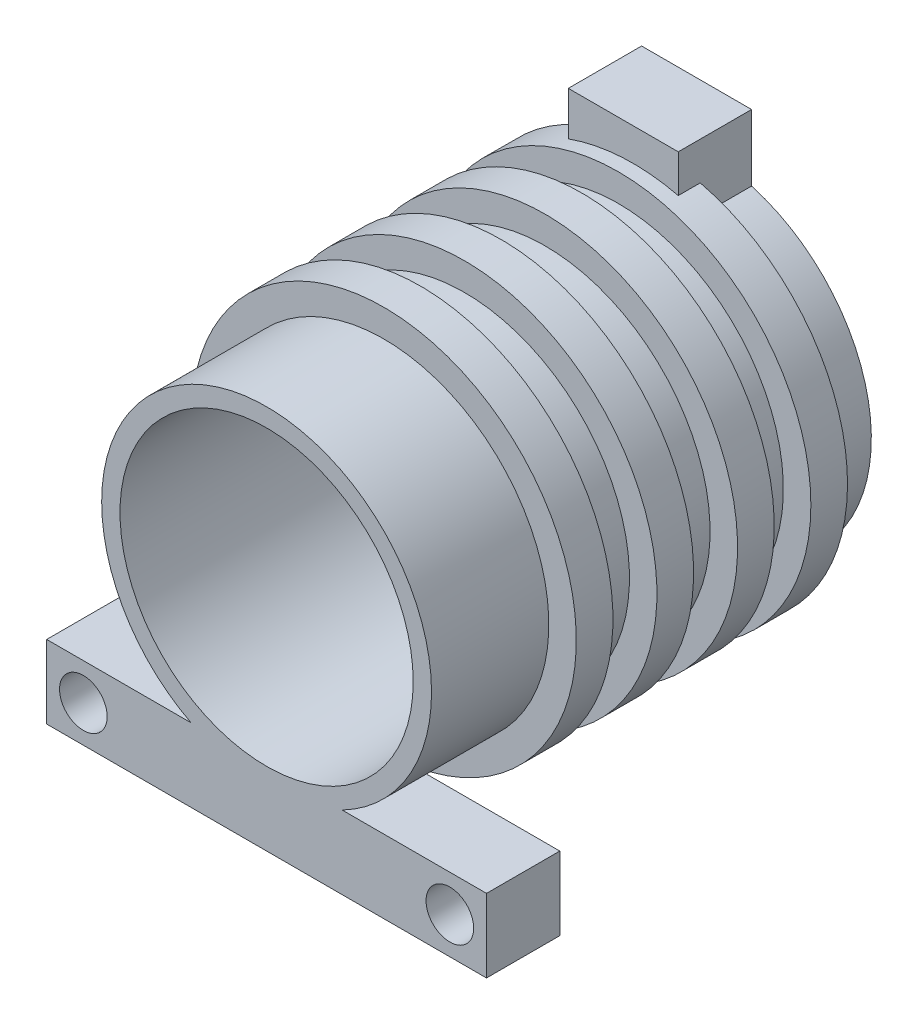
ISO-10303-21;
HEADER;
FILE_DESCRIPTION(('STEP AP214'),'2;1');
FILE_NAME('part.step','',(''),(''),'','','');
FILE_SCHEMA(('AUTOMOTIVE_DESIGN { 1 0 10303 214 1 1 1 1 }'));
ENDSEC;
DATA;
#1=APPLICATION_CONTEXT('core data for automotive mechanical design processes');
#2=APPLICATION_PROTOCOL_DEFINITION('international standard','automotive_design',2000,#1);
#3=PRODUCT_CONTEXT('',#1,'mechanical');
#4=PRODUCT('Part','Part','',(#3));
#5=PRODUCT_RELATED_PRODUCT_CATEGORY('part','',(#4));
#6=PRODUCT_DEFINITION_FORMATION('','',#4);
#7=PRODUCT_DEFINITION_CONTEXT('part definition',#1,'design');
#8=PRODUCT_DEFINITION('design','',#6,#7);
#9=PRODUCT_DEFINITION_SHAPE('','',#8);
#10=(LENGTH_UNIT() NAMED_UNIT(*) SI_UNIT(.MILLI.,.METRE.));
#11=(NAMED_UNIT(*) PLANE_ANGLE_UNIT() SI_UNIT($,.RADIAN.));
#12=(NAMED_UNIT(*) SI_UNIT($,.STERADIAN.) SOLID_ANGLE_UNIT());
#13=UNCERTAINTY_MEASURE_WITH_UNIT(LENGTH_MEASURE(1.E-05),#10,'distance_accuracy_value','');
#14=(GEOMETRIC_REPRESENTATION_CONTEXT(3) GLOBAL_UNCERTAINTY_ASSIGNED_CONTEXT((#13)) GLOBAL_UNIT_ASSIGNED_CONTEXT((#10,
#11,#12)) REPRESENTATION_CONTEXT('',''));
#15=CARTESIAN_POINT('',(0.,0.,0.));
#16=DIRECTION('',(0.,0.,1.));
#17=DIRECTION('',(1.,0.,0.));
#18=AXIS2_PLACEMENT_3D('',#15,#16,#17);
#19=CARTESIAN_POINT('',(0.,0.,152.4));
#20=DIRECTION('',(0.,0.,-1.));
#21=DIRECTION('',(-1.,0.,0.));
#22=AXIS2_PLACEMENT_3D('',#19,#20,#21);
#23=CYLINDRICAL_SURFACE('',#22,57.15);
#24=CARTESIAN_POINT('',(0.,0.,43.18));
#25=DIRECTION('',(0.,0.,-1.));
#26=DIRECTION('',(-1.,0.,0.));
#27=AXIS2_PLACEMENT_3D('',#24,#25,#26);
#28=CIRCLE('',#27,57.15);
#29=CARTESIAN_POINT('',(-57.15,0.,43.18));
#30=VERTEX_POINT('',#29);
#31=EDGE_CURVE('E191',#30,#30,#28,.T.);
#32=CARTESIAN_POINT('',(0.,0.,30.48));
#33=DIRECTION('',(0.,0.,-1.));
#34=DIRECTION('',(-1.,0.,0.));
#35=AXIS2_PLACEMENT_3D('',#32,#33,#34);
#36=CIRCLE('',#35,57.15);
#37=CARTESIAN_POINT('',(-57.15,0.,30.48));
#38=VERTEX_POINT('',#37);
#39=EDGE_CURVE('E328',#38,#38,#36,.T.);
#40=CARTESIAN_POINT('',(-57.15,0.,43.18));
#41=CARTESIAN_POINT('',(-57.15,0.,43.0477083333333));
#42=CARTESIAN_POINT('',(-57.15,0.,42.9154166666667));
#43=CARTESIAN_POINT('',(-57.15,0.,42.6508333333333));
#44=CARTESIAN_POINT('',(-57.15,0.,42.5185416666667));
#45=CARTESIAN_POINT('',(-57.15,0.,42.2539583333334));
#46=CARTESIAN_POINT('',(-57.15,0.,42.1216666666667));
#47=CARTESIAN_POINT('',(-57.15,0.,41.8570833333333));
#48=CARTESIAN_POINT('',(-57.15,0.,41.7247916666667));
#49=CARTESIAN_POINT('',(-57.15,0.,41.4602083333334));
#50=CARTESIAN_POINT('',(-57.15,0.,41.3279166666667));
#51=CARTESIAN_POINT('',(-57.15,0.,41.0633333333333));
#52=CARTESIAN_POINT('',(-57.15,0.,40.9310416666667));
#53=CARTESIAN_POINT('',(-57.15,0.,40.6664583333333));
#54=CARTESIAN_POINT('',(-57.15,0.,40.5341666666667));
#55=CARTESIAN_POINT('',(-57.15,0.,40.2695833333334));
#56=CARTESIAN_POINT('',(-57.15,0.,40.1372916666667));
#57=CARTESIAN_POINT('',(-57.15,0.,39.8727083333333));
#58=CARTESIAN_POINT('',(-57.15,0.,39.7404166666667));
#59=CARTESIAN_POINT('',(-57.15,0.,39.4758333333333));
#60=CARTESIAN_POINT('',(-57.15,0.,39.3435416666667));
#61=CARTESIAN_POINT('',(-57.15,0.,39.0789583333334));
#62=CARTESIAN_POINT('',(-57.15,0.,38.9466666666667));
#63=CARTESIAN_POINT('',(-57.15,0.,38.6820833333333));
#64=CARTESIAN_POINT('',(-57.15,0.,38.5497916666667));
#65=CARTESIAN_POINT('',(-57.15,0.,38.2852083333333));
#66=CARTESIAN_POINT('',(-57.15,0.,38.1529166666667));
#67=CARTESIAN_POINT('',(-57.15,0.,37.8883333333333));
#68=CARTESIAN_POINT('',(-57.15,0.,37.7560416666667));
#69=CARTESIAN_POINT('',(-57.15,0.,37.4914583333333));
#70=CARTESIAN_POINT('',(-57.15,0.,37.3591666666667));
#71=CARTESIAN_POINT('',(-57.15,0.,37.0945833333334));
#72=CARTESIAN_POINT('',(-57.15,0.,36.9622916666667));
#73=CARTESIAN_POINT('',(-57.15,0.,36.6977083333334));
#74=CARTESIAN_POINT('',(-57.15,0.,36.5654166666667));
#75=CARTESIAN_POINT('',(-57.15,0.,36.3008333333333));
#76=CARTESIAN_POINT('',(-57.15,0.,36.1685416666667));
#77=CARTESIAN_POINT('',(-57.15,0.,35.9039583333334));
#78=CARTESIAN_POINT('',(-57.15,0.,35.7716666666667));
#79=CARTESIAN_POINT('',(-57.15,0.,35.5070833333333));
#80=CARTESIAN_POINT('',(-57.15,0.,35.3747916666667));
#81=CARTESIAN_POINT('',(-57.15,0.,35.1102083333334));
#82=CARTESIAN_POINT('',(-57.15,0.,34.9779166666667));
#83=CARTESIAN_POINT('',(-57.15,0.,34.7133333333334));
#84=CARTESIAN_POINT('',(-57.15,0.,34.5810416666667));
#85=CARTESIAN_POINT('',(-57.15,0.,34.3164583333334));
#86=CARTESIAN_POINT('',(-57.15,0.,34.1841666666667));
#87=CARTESIAN_POINT('',(-57.15,0.,33.9195833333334));
#88=CARTESIAN_POINT('',(-57.15,0.,33.7872916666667));
#89=CARTESIAN_POINT('',(-57.15,0.,33.5227083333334));
#90=CARTESIAN_POINT('',(-57.15,0.,33.3904166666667));
#91=CARTESIAN_POINT('',(-57.15,0.,33.1258333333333));
#92=CARTESIAN_POINT('',(-57.15,0.,32.9935416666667));
#93=CARTESIAN_POINT('',(-57.15,0.,32.7289583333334));
#94=CARTESIAN_POINT('',(-57.15,0.,32.5966666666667));
#95=CARTESIAN_POINT('',(-57.15,0.,32.3320833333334));
#96=CARTESIAN_POINT('',(-57.15,0.,32.1997916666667));
#97=CARTESIAN_POINT('',(-57.15,0.,31.9352083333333));
#98=CARTESIAN_POINT('',(-57.15,0.,31.8029166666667));
#99=CARTESIAN_POINT('',(-57.15,0.,31.5383333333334));
#100=CARTESIAN_POINT('',(-57.15,0.,31.4060416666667));
#101=CARTESIAN_POINT('',(-57.15,0.,31.1414583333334));
#102=CARTESIAN_POINT('',(-57.15,0.,31.0091666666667));
#103=CARTESIAN_POINT('',(-57.15,0.,30.7445833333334));
#104=CARTESIAN_POINT('',(-57.15,0.,30.6122916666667));
#105=CARTESIAN_POINT('',(-57.15,0.,30.48));
#106=B_SPLINE_CURVE_WITH_KNOTS('',3,(#40,#41,#42,#43,#44,#45,#46,#47,#48,#49,#50,#51,#52,#53,
#54,#55,#56,#57,#58,#59,#60,#61,#62,#63,#64,#65,#66,#67,#68,#69,#70,#71,#72,#73,#74,#75,#76,#77,
#78,#79,#80,#81,#82,#83,#84,#85,#86,#87,#88,#89,#90,#91,#92,#93,#94,#95,#96,#97,#98,#99,#100,
#101,#102,#103,#104,#105),.UNSPECIFIED.,.F.,.F.,(4,2,2,2,2,2,2,2,2,2,2,2,2,2,2,2,2,2,2,2,2,2,2,
2,2,2,2,2,2,2,2,2,4),(0.,0.396875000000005,0.793749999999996,1.190625,1.58749999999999,1.984375,
2.38125,2.77812499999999,3.175,3.571875,3.96874999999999,4.365625,4.7625,5.15937499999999,
5.55625,5.95312499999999,6.34999999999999,6.746875,7.14374999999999,7.540625,7.93749999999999,
8.33437499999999,8.73125,9.12812499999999,9.52499999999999,9.921875,10.31875,10.715625,11.1125,
11.509375,11.90625,12.303125,12.7),.UNSPECIFIED.);
#107=EDGE_CURVE('BSEAM41',#30,#38,#106,.T.);
#108=ORIENTED_EDGE('',*,*,#31,.T.);
#109=ORIENTED_EDGE('',*,*,#39,.F.);
#110=ORIENTED_EDGE('',*,*,#107,.T.);
#111=ORIENTED_EDGE('',*,*,#107,.F.);
#112=EDGE_LOOP('',(#108,#110,#109,#111));
#113=FACE_BOUND('',#112,.T.);
#114=ADVANCED_FACE('F41',(#113),#23,.T.);
#115=CARTESIAN_POINT('',(0.,0.,71.12));
#116=DIRECTION('',(0.,0.,-1.));
#117=DIRECTION('',(-1.,0.,0.));
#118=AXIS2_PLACEMENT_3D('',#115,#116,#117);
#119=CIRCLE('',#118,57.15);
#120=CARTESIAN_POINT('',(-57.15,0.,71.12));
#121=VERTEX_POINT('',#120);
#122=EDGE_CURVE('E203',#121,#121,#119,.T.);
#123=CARTESIAN_POINT('',(0.,0.,55.88));
#124=DIRECTION('',(0.,0.,-1.));
#125=DIRECTION('',(-1.,0.,0.));
#126=AXIS2_PLACEMENT_3D('',#123,#124,#125);
#127=CIRCLE('',#126,57.15);
#128=CARTESIAN_POINT('',(-57.15,0.,55.88));
#129=VERTEX_POINT('',#128);
#130=EDGE_CURVE('E324',#129,#129,#127,.T.);
#131=CARTESIAN_POINT('',(-57.15,0.,71.12));
#132=CARTESIAN_POINT('',(-57.15,0.,70.96125));
#133=CARTESIAN_POINT('',(-57.15,0.,70.8025));
#134=CARTESIAN_POINT('',(-57.15,0.,70.485));
#135=CARTESIAN_POINT('',(-57.15,0.,70.32625));
#136=CARTESIAN_POINT('',(-57.15,0.,70.00875));
#137=CARTESIAN_POINT('',(-57.15,0.,69.85));
#138=CARTESIAN_POINT('',(-57.15,0.,69.5325));
#139=CARTESIAN_POINT('',(-57.15,0.,69.37375));
#140=CARTESIAN_POINT('',(-57.15,0.,69.05625));
#141=CARTESIAN_POINT('',(-57.15,0.,68.8975));
#142=CARTESIAN_POINT('',(-57.15,0.,68.58));
#143=CARTESIAN_POINT('',(-57.15,0.,68.42125));
#144=CARTESIAN_POINT('',(-57.15,0.,68.10375));
#145=CARTESIAN_POINT('',(-57.15,0.,67.945));
#146=CARTESIAN_POINT('',(-57.15,0.,67.6275));
#147=CARTESIAN_POINT('',(-57.15,0.,67.46875));
#148=CARTESIAN_POINT('',(-57.15,0.,67.15125));
#149=CARTESIAN_POINT('',(-57.15,0.,66.9925));
#150=CARTESIAN_POINT('',(-57.15,0.,66.675));
#151=CARTESIAN_POINT('',(-57.15,0.,66.51625));
#152=CARTESIAN_POINT('',(-57.15,0.,66.19875));
#153=CARTESIAN_POINT('',(-57.15,0.,66.04));
#154=CARTESIAN_POINT('',(-57.15,0.,65.7225));
#155=CARTESIAN_POINT('',(-57.15,0.,65.56375));
#156=CARTESIAN_POINT('',(-57.15,0.,65.24625));
#157=CARTESIAN_POINT('',(-57.15,0.,65.0875));
#158=CARTESIAN_POINT('',(-57.15,0.,64.77));
#159=CARTESIAN_POINT('',(-57.15,0.,64.61125));
#160=CARTESIAN_POINT('',(-57.15,0.,64.29375));
#161=CARTESIAN_POINT('',(-57.15,0.,64.135));
#162=CARTESIAN_POINT('',(-57.15,0.,63.8175));
#163=CARTESIAN_POINT('',(-57.15,0.,63.65875));
#164=CARTESIAN_POINT('',(-57.15,0.,63.34125));
#165=CARTESIAN_POINT('',(-57.15,0.,63.1825));
#166=CARTESIAN_POINT('',(-57.15,0.,62.865));
#167=CARTESIAN_POINT('',(-57.15,0.,62.70625));
#168=CARTESIAN_POINT('',(-57.15,0.,62.38875));
#169=CARTESIAN_POINT('',(-57.15,0.,62.23));
#170=CARTESIAN_POINT('',(-57.15,0.,61.9125));
#171=CARTESIAN_POINT('',(-57.15,0.,61.75375));
#172=CARTESIAN_POINT('',(-57.15,0.,61.43625));
#173=CARTESIAN_POINT('',(-57.15,0.,61.2775));
#174=CARTESIAN_POINT('',(-57.15,0.,60.96));
#175=CARTESIAN_POINT('',(-57.15,0.,60.80125));
#176=CARTESIAN_POINT('',(-57.15,0.,60.48375));
#177=CARTESIAN_POINT('',(-57.15,0.,60.325));
#178=CARTESIAN_POINT('',(-57.15,0.,60.0075));
#179=CARTESIAN_POINT('',(-57.15,0.,59.84875));
#180=CARTESIAN_POINT('',(-57.15,0.,59.53125));
#181=CARTESIAN_POINT('',(-57.15,0.,59.3725));
#182=CARTESIAN_POINT('',(-57.15,0.,59.055));
#183=CARTESIAN_POINT('',(-57.15,0.,58.89625));
#184=CARTESIAN_POINT('',(-57.15,0.,58.57875));
#185=CARTESIAN_POINT('',(-57.15,0.,58.42));
#186=CARTESIAN_POINT('',(-57.15,0.,58.1025));
#187=CARTESIAN_POINT('',(-57.15,0.,57.94375));
#188=CARTESIAN_POINT('',(-57.15,0.,57.62625));
#189=CARTESIAN_POINT('',(-57.15,0.,57.4675));
#190=CARTESIAN_POINT('',(-57.15,0.,57.15));
#191=CARTESIAN_POINT('',(-57.15,0.,56.99125));
#192=CARTESIAN_POINT('',(-57.15,0.,56.67375));
#193=CARTESIAN_POINT('',(-57.15,0.,56.515));
#194=CARTESIAN_POINT('',(-57.15,0.,56.1975));
#195=CARTESIAN_POINT('',(-57.15,0.,56.03875));
#196=CARTESIAN_POINT('',(-57.15,0.,55.88));
#197=B_SPLINE_CURVE_WITH_KNOTS('',3,(#131,#132,#133,#134,#135,#136,#137,#138,#139,#140,#141,
#142,#143,#144,#145,#146,#147,#148,#149,#150,#151,#152,#153,#154,#155,#156,#157,#158,#159,#160,
#161,#162,#163,#164,#165,#166,#167,#168,#169,#170,#171,#172,#173,#174,#175,#176,#177,#178,#179,
#180,#181,#182,#183,#184,#185,#186,#187,#188,#189,#190,#191,#192,#193,#194,#195,#196),
.UNSPECIFIED.,.F.,.F.,(4,2,2,2,2,2,2,2,2,2,2,2,2,2,2,2,2,2,2,2,2,2,2,2,2,2,2,2,2,2,2,2,4),(0.,
0.476249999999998,0.952499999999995,1.42875000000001,1.905,2.38125,2.8575,3.33375,
3.81000000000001,4.28625000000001,4.7625,5.23875,5.715,6.19125,6.66750000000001,7.14375,7.62,
8.09625,8.5725,9.04874999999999,9.52500000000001,10.00125,10.4775,10.95375,11.43,11.90625,
12.3825,12.85875,13.335,13.81125,14.2875,14.76375,15.24),.UNSPECIFIED.);
#198=EDGE_CURVE('BSEAM366',#121,#129,#197,.T.);
#199=ORIENTED_EDGE('',*,*,#122,.T.);
#200=ORIENTED_EDGE('',*,*,#130,.F.);
#201=ORIENTED_EDGE('',*,*,#198,.T.);
#202=ORIENTED_EDGE('',*,*,#198,.F.);
#203=EDGE_LOOP('',(#199,#201,#200,#202));
#204=FACE_BOUND('',#203,.T.);
#205=ADVANCED_FACE('F366',(#204),#23,.T.);
#206=CARTESIAN_POINT('',(0.,0.,99.06));
#207=DIRECTION('',(0.,0.,-1.));
#208=DIRECTION('',(-1.,0.,0.));
#209=AXIS2_PLACEMENT_3D('',#206,#207,#208);
#210=CIRCLE('',#209,57.15);
#211=CARTESIAN_POINT('',(-57.15,0.,99.06));
#212=VERTEX_POINT('',#211);
#213=EDGE_CURVE('E215',#212,#212,#210,.T.);
#214=CARTESIAN_POINT('',(0.,0.,83.82));
#215=DIRECTION('',(0.,0.,-1.));
#216=DIRECTION('',(-1.,0.,0.));
#217=AXIS2_PLACEMENT_3D('',#214,#215,#216);
#218=CIRCLE('',#217,57.15);
#219=CARTESIAN_POINT('',(-57.15,0.,83.82));
#220=VERTEX_POINT('',#219);
#221=EDGE_CURVE('E320',#220,#220,#218,.T.);
#222=CARTESIAN_POINT('',(-57.15,0.,99.06));
#223=CARTESIAN_POINT('',(-57.15,0.,98.90125));
#224=CARTESIAN_POINT('',(-57.15,0.,98.7425));
#225=CARTESIAN_POINT('',(-57.15,0.,98.425));
#226=CARTESIAN_POINT('',(-57.15,0.,98.26625));
#227=CARTESIAN_POINT('',(-57.15,0.,97.94875));
#228=CARTESIAN_POINT('',(-57.15,0.,97.79));
#229=CARTESIAN_POINT('',(-57.15,0.,97.4725));
#230=CARTESIAN_POINT('',(-57.15,0.,97.31375));
#231=CARTESIAN_POINT('',(-57.15,0.,96.99625));
#232=CARTESIAN_POINT('',(-57.15,0.,96.8375));
#233=CARTESIAN_POINT('',(-57.15,0.,96.52));
#234=CARTESIAN_POINT('',(-57.15,0.,96.36125));
#235=CARTESIAN_POINT('',(-57.15,0.,96.04375));
#236=CARTESIAN_POINT('',(-57.15,0.,95.885));
#237=CARTESIAN_POINT('',(-57.15,0.,95.5675));
#238=CARTESIAN_POINT('',(-57.15,0.,95.40875));
#239=CARTESIAN_POINT('',(-57.15,0.,95.09125));
#240=CARTESIAN_POINT('',(-57.15,0.,94.9325));
#241=CARTESIAN_POINT('',(-57.15,0.,94.615));
#242=CARTESIAN_POINT('',(-57.15,0.,94.45625));
#243=CARTESIAN_POINT('',(-57.15,0.,94.13875));
#244=CARTESIAN_POINT('',(-57.15,0.,93.98));
#245=CARTESIAN_POINT('',(-57.15,0.,93.6625));
#246=CARTESIAN_POINT('',(-57.15,0.,93.50375));
#247=CARTESIAN_POINT('',(-57.15,0.,93.18625));
#248=CARTESIAN_POINT('',(-57.15,0.,93.0275));
#249=CARTESIAN_POINT('',(-57.15,0.,92.71));
#250=CARTESIAN_POINT('',(-57.15,0.,92.55125));
#251=CARTESIAN_POINT('',(-57.15,0.,92.23375));
#252=CARTESIAN_POINT('',(-57.15,0.,92.075));
#253=CARTESIAN_POINT('',(-57.15,0.,91.7575));
#254=CARTESIAN_POINT('',(-57.15,0.,91.59875));
#255=CARTESIAN_POINT('',(-57.15,0.,91.28125));
#256=CARTESIAN_POINT('',(-57.15,0.,91.1225));
#257=CARTESIAN_POINT('',(-57.15,0.,90.805));
#258=CARTESIAN_POINT('',(-57.15,0.,90.64625));
#259=CARTESIAN_POINT('',(-57.15,0.,90.32875));
#260=CARTESIAN_POINT('',(-57.15,0.,90.17));
#261=CARTESIAN_POINT('',(-57.15,0.,89.8525));
#262=CARTESIAN_POINT('',(-57.15,0.,89.69375));
#263=CARTESIAN_POINT('',(-57.15,0.,89.37625));
#264=CARTESIAN_POINT('',(-57.15,0.,89.2175));
#265=CARTESIAN_POINT('',(-57.15,0.,88.9));
#266=CARTESIAN_POINT('',(-57.15,0.,88.74125));
#267=CARTESIAN_POINT('',(-57.15,0.,88.42375));
#268=CARTESIAN_POINT('',(-57.15,0.,88.265));
#269=CARTESIAN_POINT('',(-57.15,0.,87.9475));
#270=CARTESIAN_POINT('',(-57.15,0.,87.78875));
#271=CARTESIAN_POINT('',(-57.15,0.,87.47125));
#272=CARTESIAN_POINT('',(-57.15,0.,87.3125));
#273=CARTESIAN_POINT('',(-57.15,0.,86.995));
#274=CARTESIAN_POINT('',(-57.15,0.,86.83625));
#275=CARTESIAN_POINT('',(-57.15,0.,86.51875));
#276=CARTESIAN_POINT('',(-57.15,0.,86.36));
#277=CARTESIAN_POINT('',(-57.15,0.,86.0425));
#278=CARTESIAN_POINT('',(-57.15,0.,85.88375));
#279=CARTESIAN_POINT('',(-57.15,0.,85.56625));
#280=CARTESIAN_POINT('',(-57.15,0.,85.4075));
#281=CARTESIAN_POINT('',(-57.15,0.,85.09));
#282=CARTESIAN_POINT('',(-57.15,0.,84.93125));
#283=CARTESIAN_POINT('',(-57.15,0.,84.61375));
#284=CARTESIAN_POINT('',(-57.15,0.,84.455));
#285=CARTESIAN_POINT('',(-57.15,0.,84.1375));
#286=CARTESIAN_POINT('',(-57.15,0.,83.97875));
#287=CARTESIAN_POINT('',(-57.15,0.,83.82));
#288=B_SPLINE_CURVE_WITH_KNOTS('',3,(#222,#223,#224,#225,#226,#227,#228,#229,#230,#231,#232,
#233,#234,#235,#236,#237,#238,#239,#240,#241,#242,#243,#244,#245,#246,#247,#248,#249,#250,#251,
#252,#253,#254,#255,#256,#257,#258,#259,#260,#261,#262,#263,#264,#265,#266,#267,#268,#269,#270,
#271,#272,#273,#274,#275,#276,#277,#278,#279,#280,#281,#282,#283,#284,#285,#286,#287),
.UNSPECIFIED.,.F.,.F.,(4,2,2,2,2,2,2,2,2,2,2,2,2,2,2,2,2,2,2,2,2,2,2,2,2,2,2,2,2,2,2,2,4),(0.,
0.476249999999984,0.952499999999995,1.42874999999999,1.90499999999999,2.38125,2.85749999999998,
3.33375,3.80999999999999,4.28624999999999,4.7625,5.23874999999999,5.715,6.19125,
6.66749999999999,7.14375,7.61999999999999,8.09625,8.5725,9.04874999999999,9.52499999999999,
10.00125,10.4775,10.95375,11.43,11.90625,12.3825,12.85875,13.335,13.81125,14.2875,14.76375,
15.24),.UNSPECIFIED.);
#289=EDGE_CURVE('BSEAM371',#212,#220,#288,.T.);
#290=ORIENTED_EDGE('',*,*,#213,.T.);
#291=ORIENTED_EDGE('',*,*,#221,.F.);
#292=ORIENTED_EDGE('',*,*,#289,.T.);
#293=ORIENTED_EDGE('',*,*,#289,.F.);
#294=EDGE_LOOP('',(#290,#292,#291,#293));
#295=FACE_BOUND('',#294,.T.);
#296=ADVANCED_FACE('F371',(#295),#23,.T.);
#297=CARTESIAN_POINT('',(0.,0.,152.4));
#298=DIRECTION('',(0.,0.,1.));
#299=DIRECTION('',(1.,0.,0.));
#300=AXIS2_PLACEMENT_3D('',#297,#298,#299);
#301=CIRCLE('',#300,57.15);
#302=CARTESIAN_POINT('',(26.1817207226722,-50.8,152.4));
#303=VERTEX_POINT('',#302);
#304=CARTESIAN_POINT('',(-26.1817207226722,-50.8,152.4));
#305=VERTEX_POINT('',#304);
#306=EDGE_CURVE('E304',#303,#305,#301,.T.);
#307=ORIENTED_EDGE('',*,*,#306,.F.);
#308=DIRECTION('',(0.,0.,-1.));
#309=VECTOR('',#308,1.);
#310=CARTESIAN_POINT('',(26.1817207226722,-50.8,152.4));
#311=LINE('',#310,#309);
#312=CARTESIAN_POINT('',(26.1817207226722,-50.8,127.));
#313=VERTEX_POINT('',#312);
#314=EDGE_CURVE('E291',#303,#313,#311,.T.);
#315=ORIENTED_EDGE('',*,*,#314,.T.);
#316=CARTESIAN_POINT('',(0.,0.,127.));
#317=DIRECTION('',(0.,0.,1.));
#318=DIRECTION('',(1.,0.,0.));
#319=AXIS2_PLACEMENT_3D('',#316,#317,#318);
#320=CIRCLE('',#319,57.15);
#321=CARTESIAN_POINT('',(-26.1817207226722,-50.8,127.));
#322=VERTEX_POINT('',#321);
#323=EDGE_CURVE('E276',#322,#313,#320,.T.);
#324=ORIENTED_EDGE('',*,*,#323,.F.);
#325=DIRECTION('',(0.,0.,-1.));
#326=VECTOR('',#325,1.);
#327=CARTESIAN_POINT('',(-26.1817207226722,-50.8,152.4));
#328=LINE('',#327,#326);
#329=EDGE_CURVE('E287',#322,#305,#328,.F.);
#330=ORIENTED_EDGE('',*,*,#329,.T.);
#331=EDGE_LOOP('',(#307,#315,#324,#330));
#332=FACE_BOUND('',#331,.T.);
#333=CARTESIAN_POINT('',(0.,0.,111.76));
#334=DIRECTION('',(0.,0.,-1.));
#335=DIRECTION('',(-1.,0.,0.));
#336=AXIS2_PLACEMENT_3D('',#333,#334,#335);
#337=CIRCLE('',#336,57.15);
#338=CARTESIAN_POINT('',(-57.15,0.,111.76));
#339=VERTEX_POINT('',#338);
#340=EDGE_CURVE('E307',#339,#339,#337,.T.);
#341=ORIENTED_EDGE('',*,*,#340,.F.);
#342=EDGE_LOOP('',(#341));
#343=FACE_BOUND('',#342,.T.);
#344=ADVANCED_FACE('F375',(#332,#343),#23,.T.);
#345=CARTESIAN_POINT('',(0.,0.,0.));
#346=DIRECTION('',(0.,0.,1.));
#347=DIRECTION('',(1.,0.,0.));
#348=AXIS2_PLACEMENT_3D('',#345,#346,#347);
#349=CIRCLE('',#348,57.15);
#350=CARTESIAN_POINT('',(-22.4546853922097,52.5538733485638,0.));
#351=VERTEX_POINT('',#350);
#352=CARTESIAN_POINT('',(15.6453146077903,54.9667775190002,0.));
#353=VERTEX_POINT('',#352);
#354=EDGE_CURVE('E300',#351,#353,#349,.T.);
#355=ORIENTED_EDGE('',*,*,#354,.T.);
#356=DIRECTION('',(0.,0.,-1.));
#357=VECTOR('',#356,1.);
#358=CARTESIAN_POINT('',(15.6453146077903,54.9667775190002,25.4));
#359=LINE('',#358,#357);
#360=CARTESIAN_POINT('',(15.6453146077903,54.9667775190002,17.78));
#361=VERTEX_POINT('',#360);
#362=EDGE_CURVE('E168',#361,#353,#359,.T.);
#363=ORIENTED_EDGE('',*,*,#362,.F.);
#364=CARTESIAN_POINT('',(0.,0.,17.78));
#365=DIRECTION('',(0.,0.,-1.));
#366=DIRECTION('',(-1.,0.,0.));
#367=AXIS2_PLACEMENT_3D('',#364,#365,#366);
#368=CIRCLE('',#367,57.15);
#369=CARTESIAN_POINT('',(-22.4546853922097,52.5538733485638,17.78));
#370=VERTEX_POINT('',#369);
#371=EDGE_CURVE('E182',#361,#370,#368,.T.);
#372=ORIENTED_EDGE('',*,*,#371,.T.);
#373=DIRECTION('',(0.,0.,-1.));
#374=VECTOR('',#373,1.);
#375=CARTESIAN_POINT('',(-22.4546853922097,52.5538733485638,25.4));
#376=LINE('',#375,#374);
#377=EDGE_CURVE('E150',#370,#351,#376,.T.);
#378=ORIENTED_EDGE('',*,*,#377,.T.);
#379=EDGE_LOOP('',(#355,#363,#372,#378));
#380=FACE_BOUND('',#379,.T.);
#381=ADVANCED_FACE('F43',(#380),#23,.T.);
#382=CARTESIAN_POINT('',(0.,0.,152.4));
#383=DIRECTION('',(0.,0.,1.));
#384=DIRECTION('',(1.,0.,0.));
#385=AXIS2_PLACEMENT_3D('',#382,#383,#384);
#386=PLANE('',#385);
#387=CARTESIAN_POINT('',(-63.5,-63.5,152.4));
#388=DIRECTION('',(0.,0.,1.));
#389=DIRECTION('',(1.,0.,0.));
#390=AXIS2_PLACEMENT_3D('',#387,#388,#389);
#391=CIRCLE('',#390,8.255);
#392=CARTESIAN_POINT('',(-55.245,-63.5,152.4));
#393=VERTEX_POINT('',#392);
#394=EDGE_CURVE('E231',#393,#393,#391,.T.);
#395=ORIENTED_EDGE('',*,*,#394,.F.);
#396=EDGE_LOOP('',(#395));
#397=FACE_BOUND('',#396,.T.);
#398=CARTESIAN_POINT('',(63.5,-63.5,152.4));
#399=DIRECTION('',(0.,0.,1.));
#400=DIRECTION('',(1.,0.,0.));
#401=AXIS2_PLACEMENT_3D('',#398,#399,#400);
#402=CIRCLE('',#401,8.255);
#403=CARTESIAN_POINT('',(71.755,-63.5,152.4));
#404=VERTEX_POINT('',#403);
#405=EDGE_CURVE('E227',#404,#404,#402,.T.);
#406=ORIENTED_EDGE('',*,*,#405,.F.);
#407=EDGE_LOOP('',(#406));
#408=FACE_BOUND('',#407,.T.);
#409=CARTESIAN_POINT('',(0.,0.,152.4));
#410=DIRECTION('',(0.,0.,1.));
#411=DIRECTION('',(1.,0.,0.));
#412=AXIS2_PLACEMENT_3D('',#409,#410,#411);
#413=CIRCLE('',#412,50.8);
#414=CARTESIAN_POINT('',(50.8,0.,152.4));
#415=VERTEX_POINT('',#414);
#416=EDGE_CURVE('E295',#415,#415,#413,.T.);
#417=ORIENTED_EDGE('',*,*,#416,.F.);
#418=EDGE_LOOP('',(#417));
#419=FACE_BOUND('',#418,.T.);
#420=ORIENTED_EDGE('',*,*,#306,.T.);
#421=DIRECTION('',(-1.,0.,0.));
#422=VECTOR('',#421,1.);
#423=CARTESIAN_POINT('',(-76.2,-50.8,152.4));
#424=LINE('',#423,#422);
#425=CARTESIAN_POINT('',(-76.2,-50.8,152.4));
#426=VERTEX_POINT('',#425);
#427=EDGE_CURVE('E269',#305,#426,#424,.T.);
#428=ORIENTED_EDGE('',*,*,#427,.T.);
#429=DIRECTION('',(0.,-1.,0.));
#430=VECTOR('',#429,1.);
#431=CARTESIAN_POINT('',(-76.2,-50.8,152.4));
#432=LINE('',#431,#430);
#433=CARTESIAN_POINT('',(-76.2,-76.2,152.4));
#434=VERTEX_POINT('',#433);
#435=EDGE_CURVE('E257',#426,#434,#432,.T.);
#436=ORIENTED_EDGE('',*,*,#435,.T.);
#437=DIRECTION('',(1.,0.,0.));
#438=VECTOR('',#437,1.);
#439=CARTESIAN_POINT('',(-76.2,-76.2,152.4));
#440=LINE('',#439,#438);
#441=CARTESIAN_POINT('',(76.2,-76.2,152.4));
#442=VERTEX_POINT('',#441);
#443=EDGE_CURVE('E261',#434,#442,#440,.T.);
#444=ORIENTED_EDGE('',*,*,#443,.T.);
#445=DIRECTION('',(0.,1.,0.));
#446=VECTOR('',#445,1.);
#447=CARTESIAN_POINT('',(76.2,-50.8,152.4));
#448=LINE('',#447,#446);
#449=CARTESIAN_POINT('',(76.2,-50.8,152.4));
#450=VERTEX_POINT('',#449);
#451=EDGE_CURVE('E266',#442,#450,#448,.T.);
#452=ORIENTED_EDGE('',*,*,#451,.T.);
#453=EDGE_CURVE('E65',#450,#303,#424,.T.);
#454=ORIENTED_EDGE('',*,*,#453,.T.);
#455=EDGE_LOOP('',(#420,#428,#436,#444,#452,#454));
#456=FACE_BOUND('',#455,.T.);
#457=ADVANCED_FACE('F354',(#397,#408,#419,#456),#386,.T.);
#458=CARTESIAN_POINT('',(0.,0.,0.));
#459=DIRECTION('',(0.,0.,1.));
#460=DIRECTION('',(1.,0.,0.));
#461=AXIS2_PLACEMENT_3D('',#458,#459,#460);
#462=PLANE('',#461);
#463=CARTESIAN_POINT('',(0.,0.,0.));
#464=DIRECTION('',(0.,0.,1.));
#465=DIRECTION('',(1.,0.,0.));
#466=AXIS2_PLACEMENT_3D('',#463,#464,#465);
#467=CIRCLE('',#466,50.8);
#468=CARTESIAN_POINT('',(50.8,0.,0.));
#469=VERTEX_POINT('',#468);
#470=EDGE_CURVE('E296',#469,#469,#467,.T.);
#471=ORIENTED_EDGE('',*,*,#470,.T.);
#472=EDGE_LOOP('',(#471));
#473=FACE_BOUND('',#472,.T.);
#474=ORIENTED_EDGE('',*,*,#354,.F.);
#475=DIRECTION('',(0.,1.,0.));
#476=VECTOR('',#475,1.);
#477=CARTESIAN_POINT('',(-22.4546853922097,77.9538733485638,0.));
#478=LINE('',#477,#476);
#479=CARTESIAN_POINT('',(-22.4546853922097,77.9538733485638,0.));
#480=VERTEX_POINT('',#479);
#481=EDGE_CURVE('E160',#351,#480,#478,.T.);
#482=ORIENTED_EDGE('',*,*,#481,.T.);
#483=DIRECTION('',(1.,0.,0.));
#484=VECTOR('',#483,1.);
#485=CARTESIAN_POINT('',(15.6453146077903,77.9538733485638,0.));
#486=LINE('',#485,#484);
#487=CARTESIAN_POINT('',(15.6453146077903,77.9538733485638,0.));
#488=VERTEX_POINT('',#487);
#489=EDGE_CURVE('E146',#480,#488,#486,.T.);
#490=ORIENTED_EDGE('',*,*,#489,.T.);
#491=DIRECTION('',(0.,-1.,0.));
#492=VECTOR('',#491,1.);
#493=CARTESIAN_POINT('',(15.6453146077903,54.9667775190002,0.));
#494=LINE('',#493,#492);
#495=EDGE_CURVE('E139',#488,#353,#494,.T.);
#496=ORIENTED_EDGE('',*,*,#495,.T.);
#497=EDGE_LOOP('',(#474,#482,#490,#496));
#498=FACE_BOUND('',#497,.T.);
#499=ADVANCED_FACE('F351',(#473,#498),#462,.F.);
#500=CARTESIAN_POINT('',(0.,0.,0.));
#501=DIRECTION('',(0.,0.,1.));
#502=DIRECTION('',(1.,0.,0.));
#503=AXIS2_PLACEMENT_3D('',#500,#501,#502);
#504=CYLINDRICAL_SURFACE('',#503,50.8);
#505=CARTESIAN_POINT('',(50.8,0.,0.));
#506=CARTESIAN_POINT('',(50.8,0.,1.5875));
#507=CARTESIAN_POINT('',(50.8,0.,3.175));
#508=CARTESIAN_POINT('',(50.8,0.,6.35));
#509=CARTESIAN_POINT('',(50.8,0.,7.9375));
#510=CARTESIAN_POINT('',(50.8,0.,11.1125));
#511=CARTESIAN_POINT('',(50.8,0.,12.7));
#512=CARTESIAN_POINT('',(50.8,0.,15.875));
#513=CARTESIAN_POINT('',(50.8,0.,17.4625));
#514=CARTESIAN_POINT('',(50.8,0.,20.6375));
#515=CARTESIAN_POINT('',(50.8,0.,22.225));
#516=CARTESIAN_POINT('',(50.8,0.,25.4));
#517=CARTESIAN_POINT('',(50.8,0.,26.9875));
#518=CARTESIAN_POINT('',(50.8,0.,30.1625));
#519=CARTESIAN_POINT('',(50.8,0.,31.75));
#520=CARTESIAN_POINT('',(50.8,0.,34.925));
#521=CARTESIAN_POINT('',(50.8,0.,36.5125));
#522=CARTESIAN_POINT('',(50.8,0.,39.6875));
#523=CARTESIAN_POINT('',(50.8,0.,41.275));
#524=CARTESIAN_POINT('',(50.8,0.,44.45));
#525=CARTESIAN_POINT('',(50.8,0.,46.0375));
#526=CARTESIAN_POINT('',(50.8,0.,49.2125));
#527=CARTESIAN_POINT('',(50.8,0.,50.8));
#528=CARTESIAN_POINT('',(50.8,0.,53.975));
#529=CARTESIAN_POINT('',(50.8,0.,55.5625));
#530=CARTESIAN_POINT('',(50.8,0.,58.7375));
#531=CARTESIAN_POINT('',(50.8,0.,60.325));
#532=CARTESIAN_POINT('',(50.8,0.,63.5));
#533=CARTESIAN_POINT('',(50.8,0.,65.0875));
#534=CARTESIAN_POINT('',(50.8,0.,68.2625));
#535=CARTESIAN_POINT('',(50.8,0.,69.85));
#536=CARTESIAN_POINT('',(50.8,0.,73.025));
#537=CARTESIAN_POINT('',(50.8,0.,74.6125));
#538=CARTESIAN_POINT('',(50.8,0.,77.7875));
#539=CARTESIAN_POINT('',(50.8,0.,79.375));
#540=CARTESIAN_POINT('',(50.8,0.,82.55));
#541=CARTESIAN_POINT('',(50.8,0.,84.1375));
#542=CARTESIAN_POINT('',(50.8,0.,87.3125));
#543=CARTESIAN_POINT('',(50.8,0.,88.9));
#544=CARTESIAN_POINT('',(50.8,0.,92.075));
#545=CARTESIAN_POINT('',(50.8,0.,93.6625));
#546=CARTESIAN_POINT('',(50.8,0.,96.8375));
#547=CARTESIAN_POINT('',(50.8,0.,98.425));
#548=CARTESIAN_POINT('',(50.8,0.,101.6));
#549=CARTESIAN_POINT('',(50.8,0.,103.1875));
#550=CARTESIAN_POINT('',(50.8,0.,106.3625));
#551=CARTESIAN_POINT('',(50.8,0.,107.95));
#552=CARTESIAN_POINT('',(50.8,0.,111.125));
#553=CARTESIAN_POINT('',(50.8,0.,112.7125));
#554=CARTESIAN_POINT('',(50.8,0.,115.8875));
#555=CARTESIAN_POINT('',(50.8,0.,117.475));
#556=CARTESIAN_POINT('',(50.8,0.,120.65));
#557=CARTESIAN_POINT('',(50.8,0.,122.2375));
#558=CARTESIAN_POINT('',(50.8,0.,125.4125));
#559=CARTESIAN_POINT('',(50.8,0.,127.));
#560=CARTESIAN_POINT('',(50.8,0.,130.175));
#561=CARTESIAN_POINT('',(50.8,0.,131.7625));
#562=CARTESIAN_POINT('',(50.8,0.,134.9375));
#563=CARTESIAN_POINT('',(50.8,0.,136.525));
#564=CARTESIAN_POINT('',(50.8,0.,139.7));
#565=CARTESIAN_POINT('',(50.8,0.,141.2875));
#566=CARTESIAN_POINT('',(50.8,0.,144.4625));
#567=CARTESIAN_POINT('',(50.8,0.,146.05));
#568=CARTESIAN_POINT('',(50.8,0.,149.225));
#569=CARTESIAN_POINT('',(50.8,0.,150.8125));
#570=CARTESIAN_POINT('',(50.8,0.,152.4));
#571=B_SPLINE_CURVE_WITH_KNOTS('',3,(#505,#506,#507,#508,#509,#510,#511,#512,#513,#514,#515,
#516,#517,#518,#519,#520,#521,#522,#523,#524,#525,#526,#527,#528,#529,#530,#531,#532,#533,#534,
#535,#536,#537,#538,#539,#540,#541,#542,#543,#544,#545,#546,#547,#548,#549,#550,#551,#552,#553,
#554,#555,#556,#557,#558,#559,#560,#561,#562,#563,#564,#565,#566,#567,#568,#569,#570),
.UNSPECIFIED.,.F.,.F.,(4,2,2,2,2,2,2,2,2,2,2,2,2,2,2,2,2,2,2,2,2,2,2,2,2,2,2,2,2,2,2,2,4),(0.,
4.7625,9.525,14.2875,19.05,23.8125,28.575,33.3375,38.1,42.8625,47.625,52.3875,57.15,61.9125,
66.675,71.4375,76.2,80.9625,85.725,90.4875,95.25,100.0125,104.775,109.5375,114.3,119.0625,
123.825,128.5875,133.35,138.1125,142.875,147.6375,152.4),.UNSPECIFIED.);
#572=EDGE_CURVE('BSEAM353',#469,#415,#571,.T.);
#573=ORIENTED_EDGE('',*,*,#470,.F.);
#574=ORIENTED_EDGE('',*,*,#416,.T.);
#575=ORIENTED_EDGE('',*,*,#572,.T.);
#576=ORIENTED_EDGE('',*,*,#572,.F.);
#577=EDGE_LOOP('',(#573,#575,#574,#576));
#578=FACE_BOUND('',#577,.T.);
#579=ADVANCED_FACE('F353',(#578),#504,.F.);
#580=CARTESIAN_POINT('',(-76.2,-50.8,127.));
#581=DIRECTION('',(0.,1.,0.));
#582=DIRECTION('',(0.,0.,1.));
#583=AXIS2_PLACEMENT_3D('',#580,#581,#582);
#584=PLANE('',#583);
#585=ORIENTED_EDGE('',*,*,#314,.F.);
#586=ORIENTED_EDGE('',*,*,#453,.F.);
#587=DIRECTION('',(0.,0.,1.));
#588=VECTOR('',#587,1.);
#589=CARTESIAN_POINT('',(76.2,-50.8,127.));
#590=LINE('',#589,#588);
#591=CARTESIAN_POINT('',(76.2,-50.8,127.));
#592=VERTEX_POINT('',#591);
#593=EDGE_CURVE('E277',#592,#450,#590,.T.);
#594=ORIENTED_EDGE('',*,*,#593,.F.);
#595=DIRECTION('',(-1.,0.,0.));
#596=VECTOR('',#595,1.);
#597=CARTESIAN_POINT('',(-76.2,-50.8,127.));
#598=LINE('',#597,#596);
#599=EDGE_CURVE('E252',#592,#313,#598,.T.);
#600=ORIENTED_EDGE('',*,*,#599,.T.);
#601=EDGE_LOOP('',(#585,#586,#594,#600));
#602=FACE_BOUND('',#601,.T.);
#603=ADVANCED_FACE('F360',(#602),#584,.T.);
#604=ORIENTED_EDGE('',*,*,#329,.F.);
#605=CARTESIAN_POINT('',(-76.2,-50.8,127.));
#606=VERTEX_POINT('',#605);
#607=EDGE_CURVE('E251',#322,#606,#598,.T.);
#608=ORIENTED_EDGE('',*,*,#607,.T.);
#609=DIRECTION('',(0.,0.,1.));
#610=VECTOR('',#609,1.);
#611=CARTESIAN_POINT('',(-76.2,-50.8,127.));
#612=LINE('',#611,#610);
#613=EDGE_CURVE('E272',#606,#426,#612,.T.);
#614=ORIENTED_EDGE('',*,*,#613,.T.);
#615=ORIENTED_EDGE('',*,*,#427,.F.);
#616=EDGE_LOOP('',(#604,#608,#614,#615));
#617=FACE_BOUND('',#616,.T.);
#618=ADVANCED_FACE('F427',(#617),#584,.T.);
#619=CARTESIAN_POINT('',(0.,0.,127.));
#620=DIRECTION('',(0.,0.,1.));
#621=DIRECTION('',(1.,0.,0.));
#622=AXIS2_PLACEMENT_3D('',#619,#620,#621);
#623=PLANE('',#622);
#624=CARTESIAN_POINT('',(-63.5,-63.5,127.));
#625=DIRECTION('',(0.,0.,1.));
#626=DIRECTION('',(1.,0.,0.));
#627=AXIS2_PLACEMENT_3D('',#624,#625,#626);
#628=CIRCLE('',#627,8.255);
#629=CARTESIAN_POINT('',(-55.245,-63.5,127.));
#630=VERTEX_POINT('',#629);
#631=EDGE_CURVE('E262',#630,#630,#628,.T.);
#632=ORIENTED_EDGE('',*,*,#631,.T.);
#633=EDGE_LOOP('',(#632));
#634=FACE_BOUND('',#633,.T.);
#635=CARTESIAN_POINT('',(63.5,-63.5,127.));
#636=DIRECTION('',(0.,0.,1.));
#637=DIRECTION('',(1.,0.,0.));
#638=AXIS2_PLACEMENT_3D('',#635,#636,#637);
#639=CIRCLE('',#638,8.255);
#640=CARTESIAN_POINT('',(71.755,-63.5,127.));
#641=VERTEX_POINT('',#640);
#642=EDGE_CURVE('E235',#641,#641,#639,.T.);
#643=ORIENTED_EDGE('',*,*,#642,.T.);
#644=EDGE_LOOP('',(#643));
#645=FACE_BOUND('',#644,.T.);
#646=ORIENTED_EDGE('',*,*,#607,.F.);
#647=ORIENTED_EDGE('',*,*,#323,.T.);
#648=ORIENTED_EDGE('',*,*,#599,.F.);
#649=DIRECTION('',(0.,1.,0.));
#650=VECTOR('',#649,1.);
#651=CARTESIAN_POINT('',(76.2,-50.8,127.));
#652=LINE('',#651,#650);
#653=CARTESIAN_POINT('',(76.2,-76.2,127.));
#654=VERTEX_POINT('',#653);
#655=EDGE_CURVE('E247',#654,#592,#652,.T.);
#656=ORIENTED_EDGE('',*,*,#655,.F.);
#657=DIRECTION('',(1.,0.,0.));
#658=VECTOR('',#657,1.);
#659=CARTESIAN_POINT('',(-76.2,-76.2,127.));
#660=LINE('',#659,#658);
#661=CARTESIAN_POINT('',(-76.2,-76.2,127.));
#662=VERTEX_POINT('',#661);
#663=EDGE_CURVE('E243',#662,#654,#660,.T.);
#664=ORIENTED_EDGE('',*,*,#663,.F.);
#665=DIRECTION('',(0.,-1.,0.));
#666=VECTOR('',#665,1.);
#667=CARTESIAN_POINT('',(-76.2,-50.8,127.));
#668=LINE('',#667,#666);
#669=EDGE_CURVE('E239',#606,#662,#668,.T.);
#670=ORIENTED_EDGE('',*,*,#669,.F.);
#671=EDGE_LOOP('',(#646,#647,#648,#656,#664,#670));
#672=FACE_BOUND('',#671,.T.);
#673=ADVANCED_FACE('F423',(#634,#645,#672),#623,.F.);
#674=CARTESIAN_POINT('',(-76.2,-50.8,127.));
#675=DIRECTION('',(-1.,0.,0.));
#676=DIRECTION('',(0.,-1.,0.));
#677=AXIS2_PLACEMENT_3D('',#674,#675,#676);
#678=PLANE('',#677);
#679=ORIENTED_EDGE('',*,*,#435,.F.);
#680=ORIENTED_EDGE('',*,*,#613,.F.);
#681=ORIENTED_EDGE('',*,*,#669,.T.);
#682=DIRECTION('',(0.,0.,1.));
#683=VECTOR('',#682,1.);
#684=CARTESIAN_POINT('',(-76.2,-76.2,127.));
#685=LINE('',#684,#683);
#686=EDGE_CURVE('E256',#662,#434,#685,.T.);
#687=ORIENTED_EDGE('',*,*,#686,.T.);
#688=EDGE_LOOP('',(#679,#680,#681,#687));
#689=FACE_BOUND('',#688,.T.);
#690=ADVANCED_FACE('F426',(#689),#678,.T.);
#691=CARTESIAN_POINT('',(76.2,-50.8,127.));
#692=DIRECTION('',(1.,0.,0.));
#693=DIRECTION('',(0.,1.,0.));
#694=AXIS2_PLACEMENT_3D('',#691,#692,#693);
#695=PLANE('',#694);
#696=ORIENTED_EDGE('',*,*,#451,.F.);
#697=DIRECTION('',(0.,0.,1.));
#698=VECTOR('',#697,1.);
#699=CARTESIAN_POINT('',(76.2,-76.2,127.));
#700=LINE('',#699,#698);
#701=EDGE_CURVE('E280',#654,#442,#700,.T.);
#702=ORIENTED_EDGE('',*,*,#701,.F.);
#703=ORIENTED_EDGE('',*,*,#655,.T.);
#704=ORIENTED_EDGE('',*,*,#593,.T.);
#705=EDGE_LOOP('',(#696,#702,#703,#704));
#706=FACE_BOUND('',#705,.T.);
#707=ADVANCED_FACE('F432',(#706),#695,.T.);
#708=CARTESIAN_POINT('',(-76.2,-76.2,127.));
#709=DIRECTION('',(0.,-1.,0.));
#710=DIRECTION('',(0.,0.,-1.));
#711=AXIS2_PLACEMENT_3D('',#708,#709,#710);
#712=PLANE('',#711);
#713=ORIENTED_EDGE('',*,*,#443,.F.);
#714=ORIENTED_EDGE('',*,*,#686,.F.);
#715=ORIENTED_EDGE('',*,*,#663,.T.);
#716=ORIENTED_EDGE('',*,*,#701,.T.);
#717=EDGE_LOOP('',(#713,#714,#715,#716));
#718=FACE_BOUND('',#717,.T.);
#719=ADVANCED_FACE('F421',(#718),#712,.T.);
#720=CARTESIAN_POINT('',(63.5,-63.5,121.92));
#721=DIRECTION('',(0.,0.,1.));
#722=DIRECTION('',(1.,0.,0.));
#723=AXIS2_PLACEMENT_3D('',#720,#721,#722);
#724=CYLINDRICAL_SURFACE('',#723,8.255);
#725=CARTESIAN_POINT('',(71.755,-63.5,152.4));
#726=CARTESIAN_POINT('',(71.755,-63.5,152.135416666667));
#727=CARTESIAN_POINT('',(71.755,-63.5,151.870833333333));
#728=CARTESIAN_POINT('',(71.755,-63.5,151.341666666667));
#729=CARTESIAN_POINT('',(71.755,-63.5,151.077083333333));
#730=CARTESIAN_POINT('',(71.755,-63.5,150.547916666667));
#731=CARTESIAN_POINT('',(71.755,-63.5,150.283333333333));
#732=CARTESIAN_POINT('',(71.755,-63.5,149.754166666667));
#733=CARTESIAN_POINT('',(71.755,-63.5,149.489583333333));
#734=CARTESIAN_POINT('',(71.755,-63.5,148.960416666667));
#735=CARTESIAN_POINT('',(71.755,-63.5,148.695833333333));
#736=CARTESIAN_POINT('',(71.755,-63.5,148.166666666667));
#737=CARTESIAN_POINT('',(71.755,-63.5,147.902083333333));
#738=CARTESIAN_POINT('',(71.755,-63.5,147.372916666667));
#739=CARTESIAN_POINT('',(71.755,-63.5,147.108333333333));
#740=CARTESIAN_POINT('',(71.755,-63.5,146.579166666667));
#741=CARTESIAN_POINT('',(71.755,-63.5,146.314583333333));
#742=CARTESIAN_POINT('',(71.755,-63.5,145.785416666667));
#743=CARTESIAN_POINT('',(71.755,-63.5,145.520833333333));
#744=CARTESIAN_POINT('',(71.755,-63.5,144.991666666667));
#745=CARTESIAN_POINT('',(71.755,-63.5,144.727083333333));
#746=CARTESIAN_POINT('',(71.755,-63.5,144.197916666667));
#747=CARTESIAN_POINT('',(71.755,-63.5,143.933333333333));
#748=CARTESIAN_POINT('',(71.755,-63.5,143.404166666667));
#749=CARTESIAN_POINT('',(71.755,-63.5,143.139583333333));
#750=CARTESIAN_POINT('',(71.755,-63.5,142.610416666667));
#751=CARTESIAN_POINT('',(71.755,-63.5,142.345833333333));
#752=CARTESIAN_POINT('',(71.755,-63.5,141.816666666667));
#753=CARTESIAN_POINT('',(71.755,-63.5,141.552083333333));
#754=CARTESIAN_POINT('',(71.755,-63.5,141.022916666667));
#755=CARTESIAN_POINT('',(71.755,-63.5,140.758333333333));
#756=CARTESIAN_POINT('',(71.755,-63.5,140.229166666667));
#757=CARTESIAN_POINT('',(71.755,-63.5,139.964583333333));
#758=CARTESIAN_POINT('',(71.755,-63.5,139.435416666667));
#759=CARTESIAN_POINT('',(71.755,-63.5,139.170833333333));
#760=CARTESIAN_POINT('',(71.755,-63.5,138.641666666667));
#761=CARTESIAN_POINT('',(71.755,-63.5,138.377083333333));
#762=CARTESIAN_POINT('',(71.755,-63.5,137.847916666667));
#763=CARTESIAN_POINT('',(71.755,-63.5,137.583333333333));
#764=CARTESIAN_POINT('',(71.755,-63.5,137.054166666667));
#765=CARTESIAN_POINT('',(71.755,-63.5,136.789583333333));
#766=CARTESIAN_POINT('',(71.755,-63.5,136.260416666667));
#767=CARTESIAN_POINT('',(71.755,-63.5,135.995833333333));
#768=CARTESIAN_POINT('',(71.755,-63.5,135.466666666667));
#769=CARTESIAN_POINT('',(71.755,-63.5,135.202083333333));
#770=CARTESIAN_POINT('',(71.755,-63.5,134.672916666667));
#771=CARTESIAN_POINT('',(71.755,-63.5,134.408333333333));
#772=CARTESIAN_POINT('',(71.755,-63.5,133.879166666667));
#773=CARTESIAN_POINT('',(71.755,-63.5,133.614583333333));
#774=CARTESIAN_POINT('',(71.755,-63.5,133.085416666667));
#775=CARTESIAN_POINT('',(71.755,-63.5,132.820833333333));
#776=CARTESIAN_POINT('',(71.755,-63.5,132.291666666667));
#777=CARTESIAN_POINT('',(71.755,-63.5,132.027083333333));
#778=CARTESIAN_POINT('',(71.755,-63.5,131.497916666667));
#779=CARTESIAN_POINT('',(71.755,-63.5,131.233333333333));
#780=CARTESIAN_POINT('',(71.755,-63.5,130.704166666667));
#781=CARTESIAN_POINT('',(71.755,-63.5,130.439583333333));
#782=CARTESIAN_POINT('',(71.755,-63.5,129.910416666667));
#783=CARTESIAN_POINT('',(71.755,-63.5,129.645833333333));
#784=CARTESIAN_POINT('',(71.755,-63.5,129.116666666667));
#785=CARTESIAN_POINT('',(71.755,-63.5,128.852083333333));
#786=CARTESIAN_POINT('',(71.755,-63.5,128.322916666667));
#787=CARTESIAN_POINT('',(71.755,-63.5,128.058333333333));
#788=CARTESIAN_POINT('',(71.755,-63.5,127.529166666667));
#789=CARTESIAN_POINT('',(71.755,-63.5,127.264583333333));
#790=CARTESIAN_POINT('',(71.755,-63.5,127.));
#791=B_SPLINE_CURVE_WITH_KNOTS('',3,(#725,#726,#727,#728,#729,#730,#731,#732,#733,#734,#735,
#736,#737,#738,#739,#740,#741,#742,#743,#744,#745,#746,#747,#748,#749,#750,#751,#752,#753,#754,
#755,#756,#757,#758,#759,#760,#761,#762,#763,#764,#765,#766,#767,#768,#769,#770,#771,#772,#773,
#774,#775,#776,#777,#778,#779,#780,#781,#782,#783,#784,#785,#786,#787,#788,#789,#790),
.UNSPECIFIED.,.F.,.F.,(4,2,2,2,2,2,2,2,2,2,2,2,2,2,2,2,2,2,2,2,2,2,2,2,2,2,2,2,2,2,2,2,4),(0.,
0.79375000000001,1.58750000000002,2.38125,3.17500000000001,3.96875000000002,4.7625,
5.55625000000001,6.35000000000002,7.14375,7.93750000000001,8.73125000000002,9.52500000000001,
10.31875,11.1125,11.90625,12.7,13.49375,14.2875,15.08125,15.875,16.66875,17.4625,18.25625,19.05,
19.84375,20.6375,21.43125,22.225,23.01875,23.8125,24.60625,25.4),.UNSPECIFIED.);
#792=EDGE_CURVE('BSEAM417',#404,#641,#791,.T.);
#793=ORIENTED_EDGE('',*,*,#405,.T.);
#794=ORIENTED_EDGE('',*,*,#642,.F.);
#795=ORIENTED_EDGE('',*,*,#792,.T.);
#796=ORIENTED_EDGE('',*,*,#792,.F.);
#797=EDGE_LOOP('',(#793,#795,#794,#796));
#798=FACE_BOUND('',#797,.T.);
#799=ADVANCED_FACE('F417',(#798),#724,.F.);
#800=CARTESIAN_POINT('',(-63.5,-63.5,121.92));
#801=DIRECTION('',(0.,0.,1.));
#802=DIRECTION('',(1.,0.,0.));
#803=AXIS2_PLACEMENT_3D('',#800,#801,#802);
#804=CYLINDRICAL_SURFACE('',#803,8.255);
#805=CARTESIAN_POINT('',(-55.245,-63.5,152.4));
#806=CARTESIAN_POINT('',(-55.245,-63.5,152.135416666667));
#807=CARTESIAN_POINT('',(-55.245,-63.5,151.870833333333));
#808=CARTESIAN_POINT('',(-55.245,-63.5,151.341666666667));
#809=CARTESIAN_POINT('',(-55.245,-63.5,151.077083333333));
#810=CARTESIAN_POINT('',(-55.245,-63.5,150.547916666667));
#811=CARTESIAN_POINT('',(-55.245,-63.5,150.283333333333));
#812=CARTESIAN_POINT('',(-55.245,-63.5,149.754166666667));
#813=CARTESIAN_POINT('',(-55.245,-63.5,149.489583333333));
#814=CARTESIAN_POINT('',(-55.245,-63.5,148.960416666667));
#815=CARTESIAN_POINT('',(-55.245,-63.5,148.695833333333));
#816=CARTESIAN_POINT('',(-55.245,-63.5,148.166666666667));
#817=CARTESIAN_POINT('',(-55.245,-63.5,147.902083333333));
#818=CARTESIAN_POINT('',(-55.245,-63.5,147.372916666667));
#819=CARTESIAN_POINT('',(-55.245,-63.5,147.108333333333));
#820=CARTESIAN_POINT('',(-55.245,-63.5,146.579166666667));
#821=CARTESIAN_POINT('',(-55.245,-63.5,146.314583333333));
#822=CARTESIAN_POINT('',(-55.245,-63.5,145.785416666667));
#823=CARTESIAN_POINT('',(-55.245,-63.5,145.520833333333));
#824=CARTESIAN_POINT('',(-55.245,-63.5,144.991666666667));
#825=CARTESIAN_POINT('',(-55.245,-63.5,144.727083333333));
#826=CARTESIAN_POINT('',(-55.245,-63.5,144.197916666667));
#827=CARTESIAN_POINT('',(-55.245,-63.5,143.933333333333));
#828=CARTESIAN_POINT('',(-55.245,-63.5,143.404166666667));
#829=CARTESIAN_POINT('',(-55.245,-63.5,143.139583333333));
#830=CARTESIAN_POINT('',(-55.245,-63.5,142.610416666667));
#831=CARTESIAN_POINT('',(-55.245,-63.5,142.345833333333));
#832=CARTESIAN_POINT('',(-55.245,-63.5,141.816666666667));
#833=CARTESIAN_POINT('',(-55.245,-63.5,141.552083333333));
#834=CARTESIAN_POINT('',(-55.245,-63.5,141.022916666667));
#835=CARTESIAN_POINT('',(-55.245,-63.5,140.758333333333));
#836=CARTESIAN_POINT('',(-55.245,-63.5,140.229166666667));
#837=CARTESIAN_POINT('',(-55.245,-63.5,139.964583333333));
#838=CARTESIAN_POINT('',(-55.245,-63.5,139.435416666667));
#839=CARTESIAN_POINT('',(-55.245,-63.5,139.170833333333));
#840=CARTESIAN_POINT('',(-55.245,-63.5,138.641666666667));
#841=CARTESIAN_POINT('',(-55.245,-63.5,138.377083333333));
#842=CARTESIAN_POINT('',(-55.245,-63.5,137.847916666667));
#843=CARTESIAN_POINT('',(-55.245,-63.5,137.583333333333));
#844=CARTESIAN_POINT('',(-55.245,-63.5,137.054166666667));
#845=CARTESIAN_POINT('',(-55.245,-63.5,136.789583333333));
#846=CARTESIAN_POINT('',(-55.245,-63.5,136.260416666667));
#847=CARTESIAN_POINT('',(-55.245,-63.5,135.995833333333));
#848=CARTESIAN_POINT('',(-55.245,-63.5,135.466666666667));
#849=CARTESIAN_POINT('',(-55.245,-63.5,135.202083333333));
#850=CARTESIAN_POINT('',(-55.245,-63.5,134.672916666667));
#851=CARTESIAN_POINT('',(-55.245,-63.5,134.408333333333));
#852=CARTESIAN_POINT('',(-55.245,-63.5,133.879166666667));
#853=CARTESIAN_POINT('',(-55.245,-63.5,133.614583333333));
#854=CARTESIAN_POINT('',(-55.245,-63.5,133.085416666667));
#855=CARTESIAN_POINT('',(-55.245,-63.5,132.820833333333));
#856=CARTESIAN_POINT('',(-55.245,-63.5,132.291666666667));
#857=CARTESIAN_POINT('',(-55.245,-63.5,132.027083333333));
#858=CARTESIAN_POINT('',(-55.245,-63.5,131.497916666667));
#859=CARTESIAN_POINT('',(-55.245,-63.5,131.233333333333));
#860=CARTESIAN_POINT('',(-55.245,-63.5,130.704166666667));
#861=CARTESIAN_POINT('',(-55.245,-63.5,130.439583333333));
#862=CARTESIAN_POINT('',(-55.245,-63.5,129.910416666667));
#863=CARTESIAN_POINT('',(-55.245,-63.5,129.645833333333));
#864=CARTESIAN_POINT('',(-55.245,-63.5,129.116666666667));
#865=CARTESIAN_POINT('',(-55.245,-63.5,128.852083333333));
#866=CARTESIAN_POINT('',(-55.245,-63.5,128.322916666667));
#867=CARTESIAN_POINT('',(-55.245,-63.5,128.058333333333));
#868=CARTESIAN_POINT('',(-55.245,-63.5,127.529166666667));
#869=CARTESIAN_POINT('',(-55.245,-63.5,127.264583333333));
#870=CARTESIAN_POINT('',(-55.245,-63.5,127.));
#871=B_SPLINE_CURVE_WITH_KNOTS('',3,(#805,#806,#807,#808,#809,#810,#811,#812,#813,#814,#815,
#816,#817,#818,#819,#820,#821,#822,#823,#824,#825,#826,#827,#828,#829,#830,#831,#832,#833,#834,
#835,#836,#837,#838,#839,#840,#841,#842,#843,#844,#845,#846,#847,#848,#849,#850,#851,#852,#853,
#854,#855,#856,#857,#858,#859,#860,#861,#862,#863,#864,#865,#866,#867,#868,#869,#870),
.UNSPECIFIED.,.F.,.F.,(4,2,2,2,2,2,2,2,2,2,2,2,2,2,2,2,2,2,2,2,2,2,2,2,2,2,2,2,2,2,2,2,4),(0.,
0.79375000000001,1.58750000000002,2.38125,3.17500000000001,3.96875000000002,4.7625,
5.55625000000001,6.35000000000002,7.14375,7.93750000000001,8.73125000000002,9.52500000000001,
10.31875,11.1125,11.90625,12.7,13.49375,14.2875,15.08125,15.875,16.66875,17.4625,18.25625,19.05,
19.84375,20.6375,21.43125,22.225,23.01875,23.8125,24.60625,25.4),.UNSPECIFIED.);
#872=EDGE_CURVE('BSEAM398',#393,#630,#871,.T.);
#873=ORIENTED_EDGE('',*,*,#394,.T.);
#874=ORIENTED_EDGE('',*,*,#631,.F.);
#875=ORIENTED_EDGE('',*,*,#872,.T.);
#876=ORIENTED_EDGE('',*,*,#872,.F.);
#877=EDGE_LOOP('',(#873,#875,#874,#876));
#878=FACE_BOUND('',#877,.T.);
#879=ADVANCED_FACE('F398',(#878),#804,.F.);
#880=CARTESIAN_POINT('',(0.,0.,111.76));
#881=DIRECTION('',(0.,0.,-1.));
#882=DIRECTION('',(-1.,0.,0.));
#883=AXIS2_PLACEMENT_3D('',#880,#881,#882);
#884=CYLINDRICAL_SURFACE('',#883,66.675);
#885=CARTESIAN_POINT('',(0.,0.,111.76));
#886=DIRECTION('',(0.,0.,-1.));
#887=DIRECTION('',(-1.,0.,0.));
#888=AXIS2_PLACEMENT_3D('',#885,#886,#887);
#889=CIRCLE('',#888,66.675);
#890=CARTESIAN_POINT('',(-66.675,0.,111.76));
#891=VERTEX_POINT('',#890);
#892=EDGE_CURVE('E223',#891,#891,#889,.T.);
#893=ORIENTED_EDGE('',*,*,#892,.T.);
#894=EDGE_LOOP('',(#893));
#895=FACE_BOUND('',#894,.T.);
#896=CARTESIAN_POINT('',(0.,0.,99.06));
#897=DIRECTION('',(0.,0.,-1.));
#898=DIRECTION('',(-1.,0.,0.));
#899=AXIS2_PLACEMENT_3D('',#896,#897,#898);
#900=CIRCLE('',#899,66.675);
#901=CARTESIAN_POINT('',(-66.675,0.,99.06));
#902=VERTEX_POINT('',#901);
#903=EDGE_CURVE('E222',#902,#902,#900,.T.);
#904=ORIENTED_EDGE('',*,*,#903,.F.);
#905=EDGE_LOOP('',(#904));
#906=FACE_BOUND('',#905,.T.);
#907=ADVANCED_FACE('F392',(#895,#906),#884,.T.);
#908=CARTESIAN_POINT('',(0.,0.,111.76));
#909=DIRECTION('',(0.,0.,-1.));
#910=DIRECTION('',(-1.,0.,0.));
#911=AXIS2_PLACEMENT_3D('',#908,#909,#910);
#912=PLANE('',#911);
#913=ORIENTED_EDGE('',*,*,#340,.T.);
#914=EDGE_LOOP('',(#913));
#915=FACE_BOUND('',#914,.T.);
#916=ORIENTED_EDGE('',*,*,#892,.F.);
#917=EDGE_LOOP('',(#916));
#918=FACE_BOUND('',#917,.T.);
#919=ADVANCED_FACE('F388',(#915,#918),#912,.F.);
#920=CARTESIAN_POINT('',(0.,0.,99.06));
#921=DIRECTION('',(0.,0.,-1.));
#922=DIRECTION('',(-1.,0.,0.));
#923=AXIS2_PLACEMENT_3D('',#920,#921,#922);
#924=PLANE('',#923);
#925=ORIENTED_EDGE('',*,*,#213,.F.);
#926=EDGE_LOOP('',(#925));
#927=FACE_BOUND('',#926,.T.);
#928=ORIENTED_EDGE('',*,*,#903,.T.);
#929=EDGE_LOOP('',(#928));
#930=FACE_BOUND('',#929,.T.);
#931=ADVANCED_FACE('F391',(#927,#930),#924,.T.);
#932=CARTESIAN_POINT('',(0.,0.,71.12));
#933=DIRECTION('',(0.,0.,-1.));
#934=DIRECTION('',(-1.,0.,0.));
#935=AXIS2_PLACEMENT_3D('',#932,#933,#934);
#936=PLANE('',#935);
#937=CARTESIAN_POINT('',(0.,0.,71.12));
#938=DIRECTION('',(0.,0.,-1.));
#939=DIRECTION('',(-1.,0.,0.));
#940=AXIS2_PLACEMENT_3D('',#937,#938,#939);
#941=CIRCLE('',#940,66.675);
#942=CARTESIAN_POINT('',(-66.675,0.,71.12));
#943=VERTEX_POINT('',#942);
#944=EDGE_CURVE('E211',#943,#943,#941,.T.);
#945=ORIENTED_EDGE('',*,*,#944,.T.);
#946=EDGE_LOOP('',(#945));
#947=FACE_BOUND('',#946,.T.);
#948=ORIENTED_EDGE('',*,*,#122,.F.);
#949=EDGE_LOOP('',(#948));
#950=FACE_BOUND('',#949,.T.);
#951=ADVANCED_FACE('F403',(#947,#950),#936,.T.);
#952=CARTESIAN_POINT('',(0.,0.,83.82));
#953=DIRECTION('',(0.,0.,-1.));
#954=DIRECTION('',(-1.,0.,0.));
#955=AXIS2_PLACEMENT_3D('',#952,#953,#954);
#956=PLANE('',#955);
#957=CARTESIAN_POINT('',(0.,0.,83.82));
#958=DIRECTION('',(0.,0.,-1.));
#959=DIRECTION('',(-1.,0.,0.));
#960=AXIS2_PLACEMENT_3D('',#957,#958,#959);
#961=CIRCLE('',#960,66.675);
#962=CARTESIAN_POINT('',(-66.675,0.,83.82));
#963=VERTEX_POINT('',#962);
#964=EDGE_CURVE('E210',#963,#963,#961,.T.);
#965=ORIENTED_EDGE('',*,*,#964,.F.);
#966=EDGE_LOOP('',(#965));
#967=FACE_BOUND('',#966,.T.);
#968=ORIENTED_EDGE('',*,*,#221,.T.);
#969=EDGE_LOOP('',(#968));
#970=FACE_BOUND('',#969,.T.);
#971=ADVANCED_FACE('F409',(#967,#970),#956,.F.);
#972=CARTESIAN_POINT('',(0.,0.,71.12));
#973=DIRECTION('',(0.,0.,1.));
#974=DIRECTION('',(1.,0.,0.));
#975=AXIS2_PLACEMENT_3D('',#972,#973,#974);
#976=CYLINDRICAL_SURFACE('',#975,66.675);
#977=ORIENTED_EDGE('',*,*,#944,.F.);
#978=EDGE_LOOP('',(#977));
#979=FACE_BOUND('',#978,.T.);
#980=ORIENTED_EDGE('',*,*,#964,.T.);
#981=EDGE_LOOP('',(#980));
#982=FACE_BOUND('',#981,.T.);
#983=ADVANCED_FACE('F525',(#979,#982),#976,.T.);
#984=CARTESIAN_POINT('',(0.,0.,43.18));
#985=DIRECTION('',(0.,0.,-1.));
#986=DIRECTION('',(-1.,0.,0.));
#987=AXIS2_PLACEMENT_3D('',#984,#985,#986);
#988=PLANE('',#987);
#989=CARTESIAN_POINT('',(0.,0.,43.18));
#990=DIRECTION('',(0.,0.,-1.));
#991=DIRECTION('',(-1.,0.,0.));
#992=AXIS2_PLACEMENT_3D('',#989,#990,#991);
#993=CIRCLE('',#992,66.675);
#994=CARTESIAN_POINT('',(-66.675,0.,43.18));
#995=VERTEX_POINT('',#994);
#996=EDGE_CURVE('E199',#995,#995,#993,.T.);
#997=ORIENTED_EDGE('',*,*,#996,.T.);
#998=EDGE_LOOP('',(#997));
#999=FACE_BOUND('',#998,.T.);
#1000=ORIENTED_EDGE('',*,*,#31,.F.);
#1001=EDGE_LOOP('',(#1000));
#1002=FACE_BOUND('',#1001,.T.);
#1003=ADVANCED_FACE('F535',(#999,#1002),#988,.T.);
#1004=CARTESIAN_POINT('',(0.,0.,55.88));
#1005=DIRECTION('',(0.,0.,-1.));
#1006=DIRECTION('',(-1.,0.,0.));
#1007=AXIS2_PLACEMENT_3D('',#1004,#1005,#1006);
#1008=PLANE('',#1007);
#1009=CARTESIAN_POINT('',(0.,0.,55.88));
#1010=DIRECTION('',(0.,0.,-1.));
#1011=DIRECTION('',(-1.,0.,0.));
#1012=AXIS2_PLACEMENT_3D('',#1009,#1010,#1011);
#1013=CIRCLE('',#1012,66.675);
#1014=CARTESIAN_POINT('',(-66.675,0.,55.88));
#1015=VERTEX_POINT('',#1014);
#1016=EDGE_CURVE('E198',#1015,#1015,#1013,.T.);
#1017=ORIENTED_EDGE('',*,*,#1016,.F.);
#1018=EDGE_LOOP('',(#1017));
#1019=FACE_BOUND('',#1018,.T.);
#1020=ORIENTED_EDGE('',*,*,#130,.T.);
#1021=EDGE_LOOP('',(#1020));
#1022=FACE_BOUND('',#1021,.T.);
#1023=ADVANCED_FACE('F550',(#1019,#1022),#1008,.F.);
#1024=CARTESIAN_POINT('',(0.,0.,43.18));
#1025=DIRECTION('',(0.,0.,1.));
#1026=DIRECTION('',(1.,0.,0.));
#1027=AXIS2_PLACEMENT_3D('',#1024,#1025,#1026);
#1028=CYLINDRICAL_SURFACE('',#1027,66.675);
#1029=ORIENTED_EDGE('',*,*,#996,.F.);
#1030=EDGE_LOOP('',(#1029));
#1031=FACE_BOUND('',#1030,.T.);
#1032=ORIENTED_EDGE('',*,*,#1016,.T.);
#1033=EDGE_LOOP('',(#1032));
#1034=FACE_BOUND('',#1033,.T.);
#1035=ADVANCED_FACE('F560',(#1031,#1034),#1028,.T.);
#1036=CARTESIAN_POINT('',(0.,0.,17.78));
#1037=DIRECTION('',(0.,0.,-1.));
#1038=DIRECTION('',(-1.,0.,0.));
#1039=AXIS2_PLACEMENT_3D('',#1036,#1037,#1038);
#1040=PLANE('',#1039);
#1041=DIRECTION('',(0.,-1.,0.));
#1042=VECTOR('',#1041,1.);
#1043=CARTESIAN_POINT('',(15.6453146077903,0.,17.78));
#1044=LINE('',#1043,#1042);
#1045=CARTESIAN_POINT('',(15.6453146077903,64.8134226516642,17.78));
#1046=VERTEX_POINT('',#1045);
#1047=EDGE_CURVE('E179',#1046,#361,#1044,.T.);
#1048=ORIENTED_EDGE('',*,*,#1047,.F.);
#1049=CARTESIAN_POINT('',(0.,0.,17.78));
#1050=DIRECTION('',(0.,0.,-1.));
#1051=DIRECTION('',(-1.,0.,0.));
#1052=AXIS2_PLACEMENT_3D('',#1049,#1050,#1051);
#1053=CIRCLE('',#1052,66.675);
#1054=CARTESIAN_POINT('',(-22.4546853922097,62.7801141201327,17.78));
#1055=VERTEX_POINT('',#1054);
#1056=EDGE_CURVE('E187',#1046,#1055,#1053,.T.);
#1057=ORIENTED_EDGE('',*,*,#1056,.T.);
#1058=DIRECTION('',(0.,1.,0.));
#1059=VECTOR('',#1058,1.);
#1060=CARTESIAN_POINT('',(-22.4546853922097,0.,17.78));
#1061=LINE('',#1060,#1059);
#1062=EDGE_CURVE('E171',#370,#1055,#1061,.T.);
#1063=ORIENTED_EDGE('',*,*,#1062,.F.);
#1064=ORIENTED_EDGE('',*,*,#371,.F.);
#1065=EDGE_LOOP('',(#1048,#1057,#1063,#1064));
#1066=FACE_BOUND('',#1065,.T.);
#1067=ADVANCED_FACE('F342',(#1066),#1040,.T.);
#1068=CARTESIAN_POINT('',(0.,0.,30.48));
#1069=DIRECTION('',(0.,0.,-1.));
#1070=DIRECTION('',(-1.,0.,0.));
#1071=AXIS2_PLACEMENT_3D('',#1068,#1069,#1070);
#1072=PLANE('',#1071);
#1073=CARTESIAN_POINT('',(0.,0.,30.48));
#1074=DIRECTION('',(0.,0.,-1.));
#1075=DIRECTION('',(-1.,0.,0.));
#1076=AXIS2_PLACEMENT_3D('',#1073,#1074,#1075);
#1077=CIRCLE('',#1076,66.675);
#1078=CARTESIAN_POINT('',(-66.675,0.,30.48));
#1079=VERTEX_POINT('',#1078);
#1080=EDGE_CURVE('E186',#1079,#1079,#1077,.T.);
#1081=ORIENTED_EDGE('',*,*,#1080,.F.);
#1082=EDGE_LOOP('',(#1081));
#1083=FACE_BOUND('',#1082,.T.);
#1084=ORIENTED_EDGE('',*,*,#39,.T.);
#1085=EDGE_LOOP('',(#1084));
#1086=FACE_BOUND('',#1085,.T.);
#1087=ADVANCED_FACE('F581',(#1083,#1086),#1072,.F.);
#1088=CARTESIAN_POINT('',(0.,0.,17.78));
#1089=DIRECTION('',(0.,0.,1.));
#1090=DIRECTION('',(1.,0.,0.));
#1091=AXIS2_PLACEMENT_3D('',#1088,#1089,#1090);
#1092=CYLINDRICAL_SURFACE('',#1091,66.675);
#1093=ORIENTED_EDGE('',*,*,#1056,.F.);
#1094=DIRECTION('',(0.,0.,1.));
#1095=VECTOR('',#1094,1.);
#1096=CARTESIAN_POINT('',(15.6453146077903,64.8134226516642,17.78));
#1097=LINE('',#1096,#1095);
#1098=CARTESIAN_POINT('',(15.6453146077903,64.8134226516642,25.4));
#1099=VERTEX_POINT('',#1098);
#1100=EDGE_CURVE('E11',#1046,#1099,#1097,.T.);
#1101=ORIENTED_EDGE('',*,*,#1100,.T.);
#1102=CARTESIAN_POINT('',(0.,0.,25.4));
#1103=DIRECTION('',(0.,0.,1.));
#1104=DIRECTION('',(1.,0.,0.));
#1105=AXIS2_PLACEMENT_3D('',#1102,#1103,#1104);
#1106=CIRCLE('',#1105,66.675);
#1107=CARTESIAN_POINT('',(-22.4546853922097,62.7801141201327,25.4));
#1108=VERTEX_POINT('',#1107);
#1109=EDGE_CURVE('E332',#1099,#1108,#1106,.T.);
#1110=ORIENTED_EDGE('',*,*,#1109,.T.);
#1111=DIRECTION('',(0.,0.,1.));
#1112=VECTOR('',#1111,1.);
#1113=CARTESIAN_POINT('',(-22.4546853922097,62.7801141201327,17.78));
#1114=LINE('',#1113,#1112);
#1115=EDGE_CURVE('E50',#1108,#1055,#1114,.F.);
#1116=ORIENTED_EDGE('',*,*,#1115,.T.);
#1117=EDGE_LOOP('',(#1093,#1101,#1110,#1116));
#1118=FACE_BOUND('',#1117,.T.);
#1119=ORIENTED_EDGE('',*,*,#1080,.T.);
#1120=EDGE_LOOP('',(#1119));
#1121=FACE_BOUND('',#1120,.T.);
#1122=ADVANCED_FACE('F337',(#1118,#1121),#1092,.T.);
#1123=CARTESIAN_POINT('',(15.6453146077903,54.9667775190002,25.4));
#1124=DIRECTION('',(1.,0.,0.));
#1125=DIRECTION('',(0.,1.,0.));
#1126=AXIS2_PLACEMENT_3D('',#1123,#1124,#1125);
#1127=PLANE('',#1126);
#1128=ORIENTED_EDGE('',*,*,#1100,.F.);
#1129=ORIENTED_EDGE('',*,*,#1047,.T.);
#1130=ORIENTED_EDGE('',*,*,#362,.T.);
#1131=ORIENTED_EDGE('',*,*,#495,.F.);
#1132=DIRECTION('',(0.,0.,-1.));
#1133=VECTOR('',#1132,1.);
#1134=CARTESIAN_POINT('',(15.6453146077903,77.9538733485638,25.4));
#1135=LINE('',#1134,#1133);
#1136=CARTESIAN_POINT('',(15.6453146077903,77.9538733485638,25.4));
#1137=VERTEX_POINT('',#1136);
#1138=EDGE_CURVE('E149',#1137,#488,#1135,.T.);
#1139=ORIENTED_EDGE('',*,*,#1138,.F.);
#1140=DIRECTION('',(0.,-1.,0.));
#1141=VECTOR('',#1140,1.);
#1142=CARTESIAN_POINT('',(15.6453146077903,54.9667775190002,25.4));
#1143=LINE('',#1142,#1141);
#1144=EDGE_CURVE('E154',#1137,#1099,#1143,.T.);
#1145=ORIENTED_EDGE('',*,*,#1144,.T.);
#1146=EDGE_LOOP('',(#1128,#1129,#1130,#1131,#1139,#1145));
#1147=FACE_BOUND('',#1146,.T.);
#1148=ADVANCED_FACE('F346',(#1147),#1127,.T.);
#1149=CARTESIAN_POINT('',(15.6453146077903,77.9538733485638,25.4));
#1150=DIRECTION('',(0.,1.,0.));
#1151=DIRECTION('',(0.,0.,1.));
#1152=AXIS2_PLACEMENT_3D('',#1149,#1150,#1151);
#1153=PLANE('',#1152);
#1154=ORIENTED_EDGE('',*,*,#489,.F.);
#1155=DIRECTION('',(0.,0.,-1.));
#1156=VECTOR('',#1155,1.);
#1157=CARTESIAN_POINT('',(-22.4546853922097,77.9538733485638,25.4));
#1158=LINE('',#1157,#1156);
#1159=CARTESIAN_POINT('',(-22.4546853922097,77.9538733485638,25.4));
#1160=VERTEX_POINT('',#1159);
#1161=EDGE_CURVE('E133',#1160,#480,#1158,.T.);
#1162=ORIENTED_EDGE('',*,*,#1161,.F.);
#1163=DIRECTION('',(1.,0.,0.));
#1164=VECTOR('',#1163,1.);
#1165=CARTESIAN_POINT('',(15.6453146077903,77.9538733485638,25.4));
#1166=LINE('',#1165,#1164);
#1167=EDGE_CURVE('E138',#1160,#1137,#1166,.T.);
#1168=ORIENTED_EDGE('',*,*,#1167,.T.);
#1169=ORIENTED_EDGE('',*,*,#1138,.T.);
#1170=EDGE_LOOP('',(#1154,#1162,#1168,#1169));
#1171=FACE_BOUND('',#1170,.T.);
#1172=ADVANCED_FACE('F143',(#1171),#1153,.T.);
#1173=CARTESIAN_POINT('',(-22.4546853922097,77.9538733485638,25.4));
#1174=DIRECTION('',(-1.,0.,0.));
#1175=DIRECTION('',(0.,0.,1.));
#1176=AXIS2_PLACEMENT_3D('',#1173,#1174,#1175);
#1177=PLANE('',#1176);
#1178=ORIENTED_EDGE('',*,*,#377,.F.);
#1179=ORIENTED_EDGE('',*,*,#1062,.T.);
#1180=ORIENTED_EDGE('',*,*,#1115,.F.);
#1181=DIRECTION('',(0.,1.,0.));
#1182=VECTOR('',#1181,1.);
#1183=CARTESIAN_POINT('',(-22.4546853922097,77.9538733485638,25.4));
#1184=LINE('',#1183,#1182);
#1185=EDGE_CURVE('E57',#1108,#1160,#1184,.T.);
#1186=ORIENTED_EDGE('',*,*,#1185,.T.);
#1187=ORIENTED_EDGE('',*,*,#1161,.T.);
#1188=ORIENTED_EDGE('',*,*,#481,.F.);
#1189=EDGE_LOOP('',(#1178,#1179,#1180,#1186,#1187,#1188));
#1190=FACE_BOUND('',#1189,.T.);
#1191=ADVANCED_FACE('F132',(#1190),#1177,.T.);
#1192=CARTESIAN_POINT('',(0.,-2.98372437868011E-13,25.4));
#1193=DIRECTION('',(0.,0.,1.));
#1194=DIRECTION('',(1.,0.,0.));
#1195=AXIS2_PLACEMENT_3D('',#1192,#1193,#1194);
#1196=PLANE('',#1195);
#1197=ORIENTED_EDGE('',*,*,#1109,.F.);
#1198=ORIENTED_EDGE('',*,*,#1144,.F.);
#1199=ORIENTED_EDGE('',*,*,#1167,.F.);
#1200=ORIENTED_EDGE('',*,*,#1185,.F.);
#1201=EDGE_LOOP('',(#1197,#1198,#1199,#1200));
#1202=FACE_BOUND('',#1201,.T.);
#1203=ADVANCED_FACE('F152',(#1202),#1196,.T.);
#1204=CLOSED_SHELL('',(#114,#205,#296,#344,#381,#457,#499,#579,#603,#618,#673,#690,#707,#719,
#799,#879,#907,#919,#931,#951,#971,#983,#1003,#1023,#1035,#1067,#1087,#1122,#1148,#1172,#1191,#1203));
#1205=MANIFOLD_SOLID_BREP('B2',#1204);
#1206=ADVANCED_BREP_SHAPE_REPRESENTATION('',(#18,#1205),#14);
#1207=SHAPE_DEFINITION_REPRESENTATION(#9,#1206);
ENDSEC;
END-ISO-10303-21;
